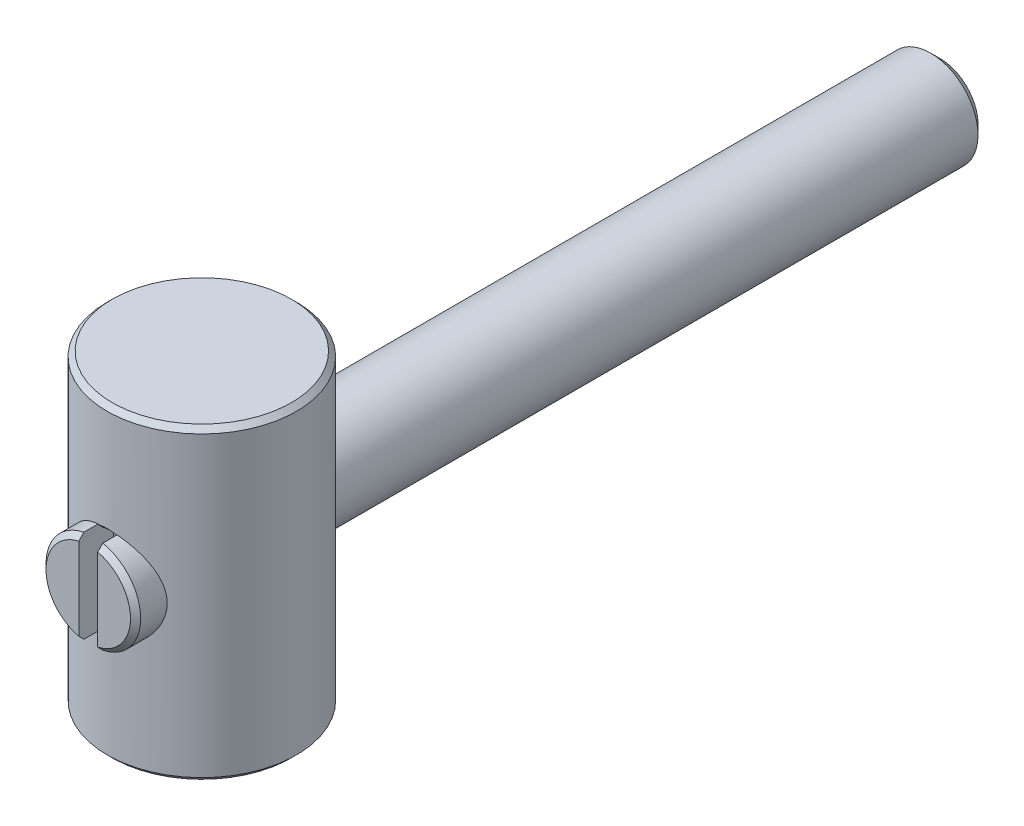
ISO-10303-21;
HEADER;
FILE_DESCRIPTION(('STEP AP214'),'2;1');
FILE_NAME('part.step','',(''),(''),'','','');
FILE_SCHEMA(('AUTOMOTIVE_DESIGN { 1 0 10303 214 1 1 1 1 }'));
ENDSEC;
DATA;
#1=APPLICATION_CONTEXT('core data for automotive mechanical design processes');
#2=APPLICATION_PROTOCOL_DEFINITION('international standard','automotive_design',2000,#1);
#3=PRODUCT_CONTEXT('',#1,'mechanical');
#4=PRODUCT('Part','Part','',(#3));
#5=PRODUCT_RELATED_PRODUCT_CATEGORY('part','',(#4));
#6=PRODUCT_DEFINITION_FORMATION('','',#4);
#7=PRODUCT_DEFINITION_CONTEXT('part definition',#1,'design');
#8=PRODUCT_DEFINITION('design','',#6,#7);
#9=PRODUCT_DEFINITION_SHAPE('','',#8);
#10=(LENGTH_UNIT() NAMED_UNIT(*) SI_UNIT(.MILLI.,.METRE.));
#11=(NAMED_UNIT(*) PLANE_ANGLE_UNIT() SI_UNIT($,.RADIAN.));
#12=(NAMED_UNIT(*) SI_UNIT($,.STERADIAN.) SOLID_ANGLE_UNIT());
#13=UNCERTAINTY_MEASURE_WITH_UNIT(LENGTH_MEASURE(1.E-05),#10,'distance_accuracy_value','');
#14=(GEOMETRIC_REPRESENTATION_CONTEXT(3) GLOBAL_UNCERTAINTY_ASSIGNED_CONTEXT((#13)) GLOBAL_UNIT_ASSIGNED_CONTEXT((#10,
#11,#12)) REPRESENTATION_CONTEXT('',''));
#15=CARTESIAN_POINT('',(0.,0.,0.));
#16=DIRECTION('',(0.,0.,1.));
#17=DIRECTION('',(1.,0.,0.));
#18=AXIS2_PLACEMENT_3D('',#15,#16,#17);
#19=CARTESIAN_POINT('',(0.,0.,4.8));
#20=DIRECTION('',(0.,0.,-1.));
#21=DIRECTION('',(-1.,0.,0.));
#22=AXIS2_PLACEMENT_3D('',#19,#20,#21);
#23=PLANE('',#22);
#24=DIRECTION('',(0.,-1.,0.));
#25=VECTOR('',#24,1.);
#26=CARTESIAN_POINT('',(-0.4,0.,4.8));
#27=LINE('',#26,#25);
#28=CARTESIAN_POINT('',(-0.4,1.74011788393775,4.8));
#29=VERTEX_POINT('',#28);
#30=CARTESIAN_POINT('',(-0.4,-1.74011788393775,4.8));
#31=VERTEX_POINT('',#30);
#32=EDGE_CURVE('E123',#29,#31,#27,.T.);
#33=ORIENTED_EDGE('',*,*,#32,.F.);
#34=CARTESIAN_POINT('',(0.,0.,4.8));
#35=DIRECTION('',(0.,0.,-1.));
#36=DIRECTION('',(-1.,0.,0.));
#37=AXIS2_PLACEMENT_3D('',#34,#35,#36);
#38=CIRCLE('',#37,1.7855);
#39=EDGE_CURVE('E122',#31,#29,#38,.T.);
#40=ORIENTED_EDGE('',*,*,#39,.F.);
#41=EDGE_LOOP('',(#33,#40));
#42=FACE_BOUND('',#41,.T.);
#43=ADVANCED_FACE('F14',(#42),#23,.F.);
#44=CARTESIAN_POINT('',(0.,0.,4.8));
#45=DIRECTION('',(0.,0.,-1.));
#46=DIRECTION('',(-1.,0.,0.));
#47=AXIS2_PLACEMENT_3D('',#44,#45,#46);
#48=CONICAL_SURFACE('',#47,1.7855,0.785398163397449);
#49=CARTESIAN_POINT('',(-0.4,4.38544390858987,2.18185170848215));
#50=CARTESIAN_POINT('',(-0.4,4.22814452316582,2.33849490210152));
#51=CARTESIAN_POINT('',(-0.4,4.07081593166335,2.49510881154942));
#52=CARTESIAN_POINT('',(-0.4,3.75604765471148,2.80824900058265));
#53=CARTESIAN_POINT('',(-0.4,3.59860796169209,2.96477527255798));
#54=CARTESIAN_POINT('',(-0.4,3.28330186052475,3.27797222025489));
#55=CARTESIAN_POINT('',(-0.4,3.12543519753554,3.43464263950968));
#56=CARTESIAN_POINT('',(-0.4,2.80949525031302,3.74775156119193));
#57=CARTESIAN_POINT('',(-0.4,2.65142198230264,3.90419007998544));
#58=CARTESIAN_POINT('',(-0.4,2.34523716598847,4.20651333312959));
#59=CARTESIAN_POINT('',(-0.4,2.19714827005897,4.35242098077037));
#60=CARTESIAN_POINT('',(-0.4,1.9745743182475,4.57086698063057));
#61=CARTESIAN_POINT('',(-0.4,1.90030121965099,4.64362119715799));
#62=CARTESIAN_POINT('',(-0.4,1.75155548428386,4.78892225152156));
#63=CARTESIAN_POINT('',(-0.4,1.67708285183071,4.86146909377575));
#64=CARTESIAN_POINT('',(-0.4,1.52792681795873,5.0061860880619));
#65=CARTESIAN_POINT('',(-0.4,1.45324372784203,5.07835656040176));
#66=CARTESIAN_POINT('',(-0.4,1.303425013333,5.22223884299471));
#67=CARTESIAN_POINT('',(-0.4,1.22828935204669,5.29395061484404));
#68=CARTESIAN_POINT('',(-0.4,1.07732483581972,5.436586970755));
#69=CARTESIAN_POINT('',(-0.4,1.00149626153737,5.50751184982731));
#70=CARTESIAN_POINT('',(-0.4,0.886762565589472,5.61281093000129));
#71=CARTESIAN_POINT('',(-0.4,0.848355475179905,5.64772694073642));
#72=CARTESIAN_POINT('',(-0.4,0.771065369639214,5.71702726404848));
#73=CARTESIAN_POINT('',(-0.4,0.732182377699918,5.75141160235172));
#74=CARTESIAN_POINT('',(-0.4,0.670990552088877,5.80440505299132));
#75=CARTESIAN_POINT('',(-0.4,0.648923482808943,5.82329300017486));
#76=CARTESIAN_POINT('',(-0.4,0.604504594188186,5.86073627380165));
#77=CARTESIAN_POINT('',(-0.4,0.582152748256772,5.87929156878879));
#78=CARTESIAN_POINT('',(-0.4,0.536811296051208,5.91617925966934));
#79=CARTESIAN_POINT('',(-0.4,0.513817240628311,5.9345062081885));
#80=CARTESIAN_POINT('',(-0.4,0.467342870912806,5.97052571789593));
#81=CARTESIAN_POINT('',(-0.4,0.443862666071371,5.98821841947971));
#82=CARTESIAN_POINT('',(-0.4,0.395899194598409,6.02295404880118));
#83=CARTESIAN_POINT('',(-0.4,0.371406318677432,6.0399838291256));
#84=CARTESIAN_POINT('',(-0.4,0.321466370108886,6.07268136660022));
#85=CARTESIAN_POINT('',(-0.4,0.296018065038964,6.08834727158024));
#86=CARTESIAN_POINT('',(-0.4,0.244218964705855,6.11732584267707));
#87=CARTESIAN_POINT('',(-0.4,0.217884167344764,6.13066640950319));
#88=CARTESIAN_POINT('',(-0.4,0.1637878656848,6.15395132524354));
#89=CARTESIAN_POINT('',(-0.4,0.136031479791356,6.16390699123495));
#90=CARTESIAN_POINT('',(-0.4,0.0811637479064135,6.17813666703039));
#91=CARTESIAN_POINT('',(-0.4,0.0541522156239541,6.18277112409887));
#92=CARTESIAN_POINT('',(-0.4,-0.000201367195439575,6.18641177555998));
#93=CARTESIAN_POINT('',(-0.4,-0.0275422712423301,6.18543380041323));
#94=CARTESIAN_POINT('',(-0.4,-0.08124913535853,6.17820280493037));
#95=CARTESIAN_POINT('',(-0.4,-0.107621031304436,6.17199093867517));
#96=CARTESIAN_POINT('',(-0.4,-0.146271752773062,6.15977299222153));
#97=CARTESIAN_POINT('',(-0.4,-0.159041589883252,6.1551986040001));
#98=CARTESIAN_POINT('',(-0.4,-0.184264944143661,6.14525020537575));
#99=CARTESIAN_POINT('',(-0.4,-0.196718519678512,6.13987634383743));
#100=CARTESIAN_POINT('',(-0.4,-0.23353200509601,6.12283069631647));
#101=CARTESIAN_POINT('',(-0.4,-0.257445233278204,6.1102004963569));
#102=CARTESIAN_POINT('',(-0.4,-0.304317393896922,6.08326318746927));
#103=CARTESIAN_POINT('',(-0.4,-0.327275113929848,6.06895403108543));
#104=CARTESIAN_POINT('',(-0.4,-0.37252645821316,6.03916204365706));
#105=CARTESIAN_POINT('',(-0.4,-0.39481743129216,6.0236752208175));
#106=CARTESIAN_POINT('',(-0.4,-0.438833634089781,5.99191398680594));
#107=CARTESIAN_POINT('',(-0.4,-0.460558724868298,5.97563938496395));
#108=CARTESIAN_POINT('',(-0.4,-0.525520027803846,5.92565754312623));
#109=CARTESIAN_POINT('',(-0.4,-0.568098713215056,5.89109840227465));
#110=CARTESIAN_POINT('',(-0.4,-0.631123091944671,5.83837882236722));
#111=CARTESIAN_POINT('',(-0.4,-0.651965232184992,5.82068135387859));
#112=CARTESIAN_POINT('',(-0.4,-0.693435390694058,5.7850382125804));
#113=CARTESIAN_POINT('',(-0.4,-0.714063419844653,5.76709255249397));
#114=CARTESIAN_POINT('',(-0.4,-0.774606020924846,5.71392260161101));
#115=CARTESIAN_POINT('',(-0.4,-0.814284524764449,5.67843014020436));
#116=CARTESIAN_POINT('',(-0.4,-0.893204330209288,5.60696168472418));
#117=CARTESIAN_POINT('',(-0.4,-0.932445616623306,5.57098567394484));
#118=CARTESIAN_POINT('',(-0.4,-1.04971807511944,5.46255349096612));
#119=CARTESIAN_POINT('',(-0.4,-1.12728939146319,5.38960072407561));
#120=CARTESIAN_POINT('',(-0.4,-1.28178514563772,5.24296666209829));
#121=CARTESIAN_POINT('',(-0.4,-1.35870936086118,5.16928513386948));
#122=CARTESIAN_POINT('',(-0.4,-1.51213277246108,5.0214909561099));
#123=CARTESIAN_POINT('',(-0.4,-1.58863199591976,4.94737833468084));
#124=CARTESIAN_POINT('',(-0.4,-1.81796193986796,4.72440140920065));
#125=CARTESIAN_POINT('',(-0.4,-1.97038982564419,4.57512336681));
#126=CARTESIAN_POINT('',(-0.4,-2.27470082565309,4.27606244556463));
#127=CARTESIAN_POINT('',(-0.4,-2.4265840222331,4.12627965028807));
#128=CARTESIAN_POINT('',(-0.4,-2.65349094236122,3.90205377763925));
#129=CARTESIAN_POINT('',(-0.4,-2.72863003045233,3.82772743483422));
#130=CARTESIAN_POINT('',(-0.4,-2.87885103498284,3.67901233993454));
#131=CARTESIAN_POINT('',(-0.4,-2.95393294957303,3.60462358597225));
#132=CARTESIAN_POINT('',(-0.4,-3.17903278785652,3.3814616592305));
#133=CARTESIAN_POINT('',(-0.4,-3.32898065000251,3.23261781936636));
#134=CARTESIAN_POINT('',(-0.4,-3.63002720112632,2.93354169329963));
#135=CARTESIAN_POINT('',(-0.4,-3.78112484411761,2.78330835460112));
#136=CARTESIAN_POINT('',(-0.4,-4.0833055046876,2.48267648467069));
#137=CARTESIAN_POINT('',(-0.4,-4.2343884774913,2.3322779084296));
#138=CARTESIAN_POINT('',(-0.4,-4.38544390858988,2.18185170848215));
#139=B_SPLINE_CURVE_WITH_KNOTS('',3,(#49,#50,#51,#52,#53,#54,#55,#56,#57,#58,#59,#60,#61,#62,
#63,#64,#65,#66,#67,#68,#69,#70,#71,#72,#73,#74,#75,#76,#77,#78,#79,#80,#81,#82,#83,#84,#85,#86,
#87,#88,#89,#90,#91,#92,#93,#94,#95,#96,#97,#98,#99,#100,#101,#102,#103,#104,#105,#106,#107,
#108,#109,#110,#111,#112,#113,#114,#115,#116,#117,#118,#119,#120,#121,#122,#123,#124,#125,#126,
#127,#128,#129,#130,#131,#132,#133,#134,#135,#136,#137,#138),.UNSPECIFIED.,.F.,.F.,(4,2,2,2,2,2,
2,2,2,2,2,2,2,2,2,2,2,2,2,2,2,2,2,2,2,2,2,2,2,2,2,2,2,2,2,2,2,2,2,2,2,2,2,2,4),(0.,
0.665974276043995,1.33199943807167,1.99923802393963,2.6664270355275,3.29010400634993,
3.60201239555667,3.91391408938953,4.22548161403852,4.53707489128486,4.84854710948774,
5.00426229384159,5.15996991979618,5.24710757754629,5.33425343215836,5.42245810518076,
5.51064313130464,5.60010728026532,5.68969108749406,5.77811232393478,5.86623495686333,
5.9479508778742,6.0294364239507,6.1102871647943,6.15096076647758,6.19162680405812,
6.27264196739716,6.35375697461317,6.43516036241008,6.5165835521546,6.68104442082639,
6.76307124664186,6.84509388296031,7.00479619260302,7.16450403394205,7.48395372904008,
7.80350915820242,8.12304398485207,8.76309054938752,9.40303588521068,9.72010458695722,
10.037183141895,10.6710202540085,11.3102423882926,11.9497829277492),.UNSPECIFIED.);
#140=CARTESIAN_POINT('',(-0.4,1.95959179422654,4.5855));
#141=VERTEX_POINT('',#140);
#142=EDGE_CURVE('E104',#141,#29,#139,.T.);
#143=ORIENTED_EDGE('',*,*,#142,.F.);
#144=CARTESIAN_POINT('',(0.,0.,4.5855));
#145=DIRECTION('',(0.,0.,-1.));
#146=DIRECTION('',(-1.,0.,0.));
#147=AXIS2_PLACEMENT_3D('',#144,#145,#146);
#148=CIRCLE('',#147,2.);
#149=CARTESIAN_POINT('',(-0.4,-1.95959179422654,4.5855));
#150=VERTEX_POINT('',#149);
#151=EDGE_CURVE('E120',#150,#141,#148,.T.);
#152=ORIENTED_EDGE('',*,*,#151,.F.);
#153=EDGE_CURVE('E126',#31,#150,#139,.T.);
#154=ORIENTED_EDGE('',*,*,#153,.F.);
#155=ORIENTED_EDGE('',*,*,#39,.T.);
#156=EDGE_LOOP('',(#143,#152,#154,#155));
#157=FACE_BOUND('',#156,.T.);
#158=ADVANCED_FACE('F118',(#157),#48,.T.);
#159=CARTESIAN_POINT('',(0.4,0.,34.8));
#160=DIRECTION('',(-1.,0.,0.));
#161=DIRECTION('',(0.,-1.,0.));
#162=AXIS2_PLACEMENT_3D('',#159,#160,#161);
#163=CYLINDRICAL_SURFACE('',#162,31.5);
#164=CARTESIAN_POINT('',(0.4,-1.76576053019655,3.34952957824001));
#165=CARTESIAN_POINT('',(0.349977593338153,-1.77709824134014,3.35016706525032));
#166=CARTESIAN_POINT('',(0.299469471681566,-1.78629930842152,3.35068890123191));
#167=CARTESIAN_POINT('',(0.197847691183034,-1.80038671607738,3.35149171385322));
#168=CARTESIAN_POINT('',(0.146733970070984,-1.8052726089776,3.35177266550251));
#169=CARTESIAN_POINT('',(0.0452193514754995,-1.81063609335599,3.35208115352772));
#170=CARTESIAN_POINT('',(-0.00517737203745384,-1.81119308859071,3.35211325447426));
#171=CARTESIAN_POINT('',(-0.105833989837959,-1.80810483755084,3.3519355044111));
#172=CARTESIAN_POINT('',(-0.156093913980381,-1.8044605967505,3.35172571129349));
#173=CARTESIAN_POINT('',(-0.238696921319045,-1.79499603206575,3.3511843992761));
#174=CARTESIAN_POINT('',(-0.271182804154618,-1.7903758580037,3.35092073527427));
#175=CARTESIAN_POINT('',(-0.335843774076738,-1.77938039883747,3.35029676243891));
#176=CARTESIAN_POINT('',(-0.368018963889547,-1.77300571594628,3.34993648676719));
#177=CARTESIAN_POINT('',(-0.4,-1.76576053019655,3.34952957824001));
#178=B_SPLINE_CURVE_WITH_KNOTS('',3,(#164,#165,#166,#167,#168,#169,#170,#171,#172,#173,#174,
#175,#176,#177),.UNSPECIFIED.,.F.,.F.,(4,2,2,2,2,2,4),(0.,0.153839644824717,0.307695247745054,
0.458721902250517,0.609712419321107,0.708108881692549,0.806471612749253),.UNSPECIFIED.);
#179=CARTESIAN_POINT('',(0.4,-1.76576053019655,3.34952957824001));
#180=VERTEX_POINT('',#179);
#181=CARTESIAN_POINT('',(-0.4,-1.76576053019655,3.34952957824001));
#182=VERTEX_POINT('',#181);
#183=EDGE_CURVE('E250',#180,#182,#178,.T.);
#184=ORIENTED_EDGE('',*,*,#183,.F.);
#185=CARTESIAN_POINT('',(0.4,0.,34.8));
#186=DIRECTION('',(1.,0.,0.));
#187=DIRECTION('',(0.,1.,0.));
#188=AXIS2_PLACEMENT_3D('',#185,#186,#187);
#189=CIRCLE('',#188,31.5);
#190=CARTESIAN_POINT('',(0.4,1.76576053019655,3.34952957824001));
#191=VERTEX_POINT('',#190);
#192=EDGE_CURVE('E124',#180,#191,#189,.T.);
#193=ORIENTED_EDGE('',*,*,#192,.T.);
#194=CARTESIAN_POINT('',(-0.4,1.76576053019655,3.34952957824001));
#195=CARTESIAN_POINT('',(-0.349977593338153,1.77709824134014,3.35016706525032));
#196=CARTESIAN_POINT('',(-0.299469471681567,1.78629930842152,3.35068890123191));
#197=CARTESIAN_POINT('',(-0.197847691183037,1.80038671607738,3.35149171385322));
#198=CARTESIAN_POINT('',(-0.146733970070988,1.8052726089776,3.35177266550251));
#199=CARTESIAN_POINT('',(-0.0452193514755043,1.81063609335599,3.35208115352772));
#200=CARTESIAN_POINT('',(0.00517737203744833,1.81119308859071,3.35211325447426));
#201=CARTESIAN_POINT('',(0.105833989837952,1.80810483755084,3.3519355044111));
#202=CARTESIAN_POINT('',(0.156093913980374,1.8044605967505,3.35172571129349));
#203=CARTESIAN_POINT('',(0.238696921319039,1.79499603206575,3.3511843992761));
#204=CARTESIAN_POINT('',(0.271182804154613,1.7903758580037,3.35092073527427));
#205=CARTESIAN_POINT('',(0.335843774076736,1.77938039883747,3.35029676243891));
#206=CARTESIAN_POINT('',(0.368018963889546,1.77300571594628,3.34993648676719));
#207=CARTESIAN_POINT('',(0.4,1.76576053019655,3.34952957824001));
#208=B_SPLINE_CURVE_WITH_KNOTS('',3,(#194,#195,#196,#197,#198,#199,#200,#201,#202,#203,#204,
#205,#206,#207),.UNSPECIFIED.,.F.,.F.,(4,2,2,2,2,2,4),(0.,0.153839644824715,0.307695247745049,
0.45872190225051,0.609712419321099,0.708108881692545,0.806471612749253),.UNSPECIFIED.);
#209=CARTESIAN_POINT('',(-0.4,1.76576053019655,3.34952957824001));
#210=VERTEX_POINT('',#209);
#211=EDGE_CURVE('E248',#210,#191,#208,.T.);
#212=ORIENTED_EDGE('',*,*,#211,.F.);
#213=CARTESIAN_POINT('',(-0.4,0.,34.8));
#214=DIRECTION('',(1.,0.,0.));
#215=DIRECTION('',(0.,1.,0.));
#216=AXIS2_PLACEMENT_3D('',#213,#214,#215);
#217=CIRCLE('',#216,31.5);
#218=EDGE_CURVE('E238',#182,#210,#217,.T.);
#219=ORIENTED_EDGE('',*,*,#218,.F.);
#220=EDGE_LOOP('',(#184,#193,#212,#219));
#221=FACE_BOUND('',#220,.T.);
#222=ADVANCED_FACE('F245',(#221),#163,.F.);
#223=CARTESIAN_POINT('',(0.,0.,-4.7));
#224=DIRECTION('',(0.,0.,-1.));
#225=DIRECTION('',(-1.,0.,0.));
#226=AXIS2_PLACEMENT_3D('',#223,#224,#225);
#227=CYLINDRICAL_SURFACE('',#226,2.);
#228=CARTESIAN_POINT('',(-2.,0.,3.46410161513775));
#229=CARTESIAN_POINT('',(-1.99999158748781,0.104213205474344,3.46411185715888));
#230=CARTESIAN_POINT('',(-1.99179963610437,0.208562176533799,3.46887633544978));
#231=CARTESIAN_POINT('',(-1.95944672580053,0.4140551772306,3.48724701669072));
#232=CARTESIAN_POINT('',(-1.93525221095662,0.51519200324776,3.50087179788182));
#233=CARTESIAN_POINT('',(-1.8721998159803,0.710903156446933,3.53498701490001));
#234=CARTESIAN_POINT('',(-1.83341988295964,0.805509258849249,3.55544089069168));
#235=CARTESIAN_POINT('',(-1.74253507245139,0.986848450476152,3.60085327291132));
#236=CARTESIAN_POINT('',(-1.69042947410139,1.07358111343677,3.62581202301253));
#237=CARTESIAN_POINT('',(-1.56933307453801,1.24461144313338,3.67993738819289));
#238=CARTESIAN_POINT('',(-1.49930407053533,1.32811826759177,3.70928127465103));
#239=CARTESIAN_POINT('',(-1.34650761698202,1.4828167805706,3.76743965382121));
#240=CARTESIAN_POINT('',(-1.26373385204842,1.55400232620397,3.79625387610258));
#241=CARTESIAN_POINT('',(-1.08097912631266,1.6867343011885,3.85242953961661));
#242=CARTESIAN_POINT('',(-0.980214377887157,1.74730753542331,3.87956212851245));
#243=CARTESIAN_POINT('',(-0.768314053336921,1.85028170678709,3.92701512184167));
#244=CARTESIAN_POINT('',(-0.65718507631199,1.8926941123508,3.94733982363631));
#245=CARTESIAN_POINT('',(-0.436089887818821,1.95500932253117,3.97760922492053));
#246=CARTESIAN_POINT('',(-0.326603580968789,1.9762990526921,3.9881896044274));
#247=CARTESIAN_POINT('',(-0.105141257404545,2.00033223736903,4.00015167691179));
#248=CARTESIAN_POINT('',(0.00683321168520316,2.00308691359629,4.00153893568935));
#249=CARTESIAN_POINT('',(0.219665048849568,1.99050665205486,3.99525963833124));
#250=CARTESIAN_POINT('',(0.320642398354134,1.97672396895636,3.98836991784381));
#251=CARTESIAN_POINT('',(0.518627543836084,1.93423831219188,3.96748490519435));
#252=CARTESIAN_POINT('',(0.615635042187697,1.90553422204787,3.95348908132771));
#253=CARTESIAN_POINT('',(0.804618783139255,1.83383486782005,3.91943166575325));
#254=CARTESIAN_POINT('',(0.896506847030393,1.79064737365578,3.89928883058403));
#255=CARTESIAN_POINT('',(1.07195360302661,1.6914731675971,3.8547529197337));
#256=CARTESIAN_POINT('',(1.15550929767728,1.63548187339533,3.83035832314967));
#257=CARTESIAN_POINT('',(1.3203473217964,1.50620929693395,3.7768878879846));
#258=CARTESIAN_POINT('',(1.40066815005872,1.43179394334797,3.74758751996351));
#259=CARTESIAN_POINT('',(1.54820874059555,1.27082055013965,3.68908681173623));
#260=CARTESIAN_POINT('',(1.61541842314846,1.18425325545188,3.65988656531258));
#261=CARTESIAN_POINT('',(1.73901066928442,0.994703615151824,3.60288312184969));
#262=CARTESIAN_POINT('',(1.7944346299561,0.891027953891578,3.57528639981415));
#263=CARTESIAN_POINT('',(1.88663822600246,0.674124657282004,3.52750900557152));
#264=CARTESIAN_POINT('',(1.92343731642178,0.560907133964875,3.50732060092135));
#265=CARTESIAN_POINT('',(1.97436042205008,0.337570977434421,3.47889271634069));
#266=CARTESIAN_POINT('',(1.99005024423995,0.227917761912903,3.46983311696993));
#267=CARTESIAN_POINT('',(2.00303389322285,0.00719731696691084,3.46235838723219));
#268=CARTESIAN_POINT('',(2.00034071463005,-0.103868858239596,3.46393573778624));
#269=CARTESIAN_POINT('',(1.97807208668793,-0.311307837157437,3.4766867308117));
#270=CARTESIAN_POINT('',(1.96037563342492,-0.407958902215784,3.48679175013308));
#271=CARTESIAN_POINT('',(1.91139256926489,-0.596735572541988,3.51388043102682));
#272=CARTESIAN_POINT('',(1.88010155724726,-0.688859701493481,3.53086632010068));
#273=CARTESIAN_POINT('',(1.80329517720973,-0.870822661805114,3.57072444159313));
#274=CARTESIAN_POINT('',(1.75718812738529,-0.96035803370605,3.59383286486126));
#275=CARTESIAN_POINT('',(1.65257412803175,-1.13093854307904,3.643122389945));
#276=CARTESIAN_POINT('',(1.59406080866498,-1.21197928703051,3.66930506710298));
#277=CARTESIAN_POINT('',(1.45767433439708,-1.37395753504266,3.72575996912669));
#278=CARTESIAN_POINT('',(1.37829054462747,-1.45359430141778,3.75613166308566));
#279=CARTESIAN_POINT('',(1.20680899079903,-1.59882447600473,3.81468469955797));
#280=CARTESIAN_POINT('',(1.1147069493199,-1.66441314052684,3.84286530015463));
#281=CARTESIAN_POINT('',(0.917070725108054,-1.78114745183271,3.89482723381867));
#282=CARTESIAN_POINT('',(0.81124619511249,-1.83186623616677,3.91847283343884));
#283=CARTESIAN_POINT('',(0.591044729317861,-1.91427580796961,3.95766709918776));
#284=CARTESIAN_POINT('',(0.476675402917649,-1.9459833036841,3.97322287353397));
#285=CARTESIAN_POINT('',(0.25395936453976,-1.98673712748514,3.99335016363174));
#286=CARTESIAN_POINT('',(0.146022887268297,-1.99759574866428,3.9987985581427));
#287=CARTESIAN_POINT('',(-0.0702519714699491,-2.00168653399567,4.00084260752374));
#288=CARTESIAN_POINT('',(-0.178590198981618,-1.99492486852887,3.99744136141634));
#289=CARTESIAN_POINT('',(-0.385075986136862,-1.96516717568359,3.98267937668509));
#290=CARTESIAN_POINT('',(-0.483424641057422,-1.94327026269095,3.97185789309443));
#291=CARTESIAN_POINT('',(-0.674891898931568,-1.88534604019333,3.94384187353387));
#292=CARTESIAN_POINT('',(-0.768009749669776,-1.84931670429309,3.92664642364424));
#293=CARTESIAN_POINT('',(-0.950846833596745,-1.7625457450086,3.8865186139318));
#294=CARTESIAN_POINT('',(-1.0402503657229,-1.71124078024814,3.86337234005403));
#295=CARTESIAN_POINT('',(-1.20954920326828,-1.59608471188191,3.81376266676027));
#296=CARTESIAN_POINT('',(-1.28944011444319,-1.53222784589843,3.78729774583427));
#297=CARTESIAN_POINT('',(-1.44582833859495,-1.38640336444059,3.73057218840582));
#298=CARTESIAN_POINT('',(-1.52119665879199,-1.30326581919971,3.70019591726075));
#299=CARTESIAN_POINT('',(-1.65732528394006,-1.12510777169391,3.64126158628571));
#300=CARTESIAN_POINT('',(-1.71807266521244,-1.03007686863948,3.61270515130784));
#301=CARTESIAN_POINT('',(-1.82486714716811,-0.826691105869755,3.55999186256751));
#302=CARTESIAN_POINT('',(-1.87038902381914,-0.718010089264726,3.53600256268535));
#303=CARTESIAN_POINT('',(-1.92395929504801,-0.549421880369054,3.5069621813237));
#304=CARTESIAN_POINT('',(-1.93935666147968,-0.492352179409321,3.49844389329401));
#305=CARTESIAN_POINT('',(-1.96508069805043,-0.376767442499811,3.48406059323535));
#306=CARTESIAN_POINT('',(-1.97541091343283,-0.318253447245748,3.4781937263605));
#307=CARTESIAN_POINT('',(-1.98872932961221,-0.21639921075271,3.47059023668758));
#308=CARTESIAN_POINT('',(-1.99295091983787,-0.173266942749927,3.46816389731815));
#309=CARTESIAN_POINT('',(-1.99858810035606,-0.0867643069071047,3.46491740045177));
#310=CARTESIAN_POINT('',(-2.00000350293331,-0.0433939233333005,3.46409735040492));
#311=CARTESIAN_POINT('',(-2.,0.,3.46410161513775));
#312=B_SPLINE_CURVE_WITH_KNOTS('',3,(#228,#229,#230,#231,#232,#233,#234,#235,#236,#237,#238,
#239,#240,#241,#242,#243,#244,#245,#246,#247,#248,#249,#250,#251,#252,#253,#254,#255,#256,#257,
#258,#259,#260,#261,#262,#263,#264,#265,#266,#267,#268,#269,#270,#271,#272,#273,#274,#275,#276,
#277,#278,#279,#280,#281,#282,#283,#284,#285,#286,#287,#288,#289,#290,#291,#292,#293,#294,#295,
#296,#297,#298,#299,#300,#301,#302,#303,#304,#305,#306,#307,#308,#309,#310,#311),.UNSPECIFIED.,
.T.,.F.,(4,2,2,2,2,2,2,2,2,2,2,2,2,2,2,2,2,2,2,2,2,2,2,2,2,2,2,2,2,2,2,2,2,2,2,2,2,2,2,2,2,4),
(0.,0.312464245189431,0.625585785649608,0.937057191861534,1.24854545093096,1.58572462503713,
1.92307142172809,2.28315784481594,2.64301653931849,2.97726969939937,3.31132047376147,
3.61632194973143,3.92134625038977,4.2305906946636,4.5399459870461,4.87854382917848,
5.21740096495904,5.57777683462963,5.93777548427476,6.2692458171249,6.60048186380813,
6.89548366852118,7.19058104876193,7.49934592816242,7.80826972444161,8.15613487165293,
8.50411729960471,8.86128362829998,9.2181355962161,9.5422454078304,9.8662417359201,
10.1688884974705,10.4715786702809,10.7872150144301,11.102996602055,11.450204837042,
11.7977188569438,12.1562149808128,12.3351395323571,12.5139387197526,12.6440387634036,
12.7741475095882),.UNSPECIFIED.);
#313=CARTESIAN_POINT('',(-0.4,-1.95959179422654,3.97994974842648));
#314=VERTEX_POINT('',#313);
#315=CARTESIAN_POINT('',(-0.4,1.95959179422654,3.97994974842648));
#316=VERTEX_POINT('',#315);
#317=EDGE_CURVE('E319',#314,#316,#312,.T.);
#318=ORIENTED_EDGE('',*,*,#317,.F.);
#319=DIRECTION('',(0.,0.,-1.));
#320=VECTOR('',#319,1.);
#321=CARTESIAN_POINT('',(-0.4,-1.95959179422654,-4.7));
#322=LINE('',#321,#320);
#323=EDGE_CURVE('E129',#150,#314,#322,.T.);
#324=ORIENTED_EDGE('',*,*,#323,.F.);
#325=ORIENTED_EDGE('',*,*,#151,.T.);
#326=DIRECTION('',(0.,0.,-1.));
#327=VECTOR('',#326,1.);
#328=CARTESIAN_POINT('',(-0.4,1.95959179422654,-4.7));
#329=LINE('',#328,#327);
#330=EDGE_CURVE('E100',#316,#141,#329,.F.);
#331=ORIENTED_EDGE('',*,*,#330,.F.);
#332=EDGE_LOOP('',(#318,#324,#325,#331));
#333=FACE_BOUND('',#332,.T.);
#334=ADVANCED_FACE('F128',(#333),#227,.T.);
#335=CARTESIAN_POINT('',(-0.4,0.,34.8));
#336=DIRECTION('',(1.,0.,0.));
#337=DIRECTION('',(0.,1.,0.));
#338=AXIS2_PLACEMENT_3D('',#335,#336,#337);
#339=PLANE('',#338);
#340=ORIENTED_EDGE('',*,*,#323,.T.);
#341=DIRECTION('',(0.,1.,0.));
#342=VECTOR('',#341,1.);
#343=CARTESIAN_POINT('',(-0.4,6.5,3.97994974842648));
#344=LINE('',#343,#342);
#345=CARTESIAN_POINT('',(-0.4,-1.93912377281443,3.97994974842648));
#346=VERTEX_POINT('',#345);
#347=EDGE_CURVE('E257',#314,#346,#344,.T.);
#348=ORIENTED_EDGE('',*,*,#347,.T.);
#349=CARTESIAN_POINT('',(-0.4,-0.624920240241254,2.74197392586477));
#350=CARTESIAN_POINT('',(-0.4,-0.652653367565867,2.76534479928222));
#351=CARTESIAN_POINT('',(-0.4,-0.680175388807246,2.7889624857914));
#352=CARTESIAN_POINT('',(-0.4,-0.734883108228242,2.83658066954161));
#353=CARTESIAN_POINT('',(-0.4,-0.762068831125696,2.86058113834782));
#354=CARTESIAN_POINT('',(-0.4,-0.843247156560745,2.93298747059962));
#355=CARTESIAN_POINT('',(-0.4,-0.896870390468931,2.98180637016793));
#356=CARTESIAN_POINT('',(-0.4,-1.00349672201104,3.0800847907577));
#357=CARTESIAN_POINT('',(-0.4,-1.05649998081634,3.12954413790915));
#358=CARTESIAN_POINT('',(-0.4,-1.16210748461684,3.22889159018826));
#359=CARTESIAN_POINT('',(-0.4,-1.21471171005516,3.2787797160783));
#360=CARTESIAN_POINT('',(-0.4,-1.34837868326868,3.40624444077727));
#361=CARTESIAN_POINT('',(-0.4,-1.42924950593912,3.48402202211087));
#362=CARTESIAN_POINT('',(-0.4,-1.59060014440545,3.63999652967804));
#363=CARTESIAN_POINT('',(-0.4,-1.67107992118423,3.71819349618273));
#364=CARTESIAN_POINT('',(-0.4,-1.84349823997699,3.88628324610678));
#365=CARTESIAN_POINT('',(-0.4,-1.93539571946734,3.97621812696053));
#366=CARTESIAN_POINT('',(-0.4,-2.11896570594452,4.15631699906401));
#367=CARTESIAN_POINT('',(-0.4,-2.21063821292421,4.24648099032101));
#368=CARTESIAN_POINT('',(-0.4,-2.39380444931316,4.42694304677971));
#369=CARTESIAN_POINT('',(-0.4,-2.48529821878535,4.51724107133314));
#370=CARTESIAN_POINT('',(-0.4,-2.66817104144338,4.69795263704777));
#371=CARTESIAN_POINT('',(-0.4,-2.75955009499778,4.78836617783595));
#372=CARTESIAN_POINT('',(-0.4,-2.85089224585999,4.87881687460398));
#373=B_SPLINE_CURVE_WITH_KNOTS('',3,(#349,#350,#351,#352,#353,#354,#355,#356,#357,#358,#359,
#360,#361,#362,#363,#364,#365,#366,#367,#368,#369,#370,#371,#372),.UNSPECIFIED.,.F.,.F.,(4,2,2,
2,2,2,2,2,2,2,2,4),(0.,0.108797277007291,0.217586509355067,0.435127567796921,0.65261075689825,
0.870104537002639,1.20670989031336,1.54334816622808,1.92909464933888,2.31484114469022,
2.70048799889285,3.08613361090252),.UNSPECIFIED.);
#374=CARTESIAN_POINT('',(-0.4,-1.76576053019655,3.8105));
#375=VERTEX_POINT('',#374);
#376=EDGE_CURVE('E189',#375,#346,#373,.T.);
#377=ORIENTED_EDGE('',*,*,#376,.F.);
#378=DIRECTION('',(0.,0.,-1.));
#379=VECTOR('',#378,1.);
#380=CARTESIAN_POINT('',(-0.4,-1.76576053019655,-4.));
#381=LINE('',#380,#379);
#382=EDGE_CURVE('E320',#182,#375,#381,.F.);
#383=ORIENTED_EDGE('',*,*,#382,.F.);
#384=ORIENTED_EDGE('',*,*,#218,.T.);
#385=DIRECTION('',(0.,0.,-1.));
#386=VECTOR('',#385,1.);
#387=CARTESIAN_POINT('',(-0.4,1.76576053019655,-4.));
#388=LINE('',#387,#386);
#389=CARTESIAN_POINT('',(-0.4,1.76576053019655,3.8105));
#390=VERTEX_POINT('',#389);
#391=EDGE_CURVE('E146',#390,#210,#388,.T.);
#392=ORIENTED_EDGE('',*,*,#391,.F.);
#393=CARTESIAN_POINT('',(-0.4,2.91587738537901,4.94318550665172));
#394=CARTESIAN_POINT('',(-0.4,2.82350327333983,4.85167351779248));
#395=CARTESIAN_POINT('',(-0.4,2.73109369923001,4.76019722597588));
#396=CARTESIAN_POINT('',(-0.4,2.54616753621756,4.57735709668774));
#397=CARTESIAN_POINT('',(-0.4,2.45365094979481,4.48599325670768));
#398=CARTESIAN_POINT('',(-0.4,2.26848279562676,4.30342707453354));
#399=CARTESIAN_POINT('',(-0.4,2.17583124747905,4.21222471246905));
#400=CARTESIAN_POINT('',(-0.4,1.99031330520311,4.03003417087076));
#401=CARTESIAN_POINT('',(-0.4,1.897446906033,3.93904599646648));
#402=CARTESIAN_POINT('',(-0.4,1.71137075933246,3.75737997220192));
#403=CARTESIAN_POINT('',(-0.4,1.61816094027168,3.66670219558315));
#404=CARTESIAN_POINT('',(-0.4,1.43123102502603,3.48588267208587));
#405=CARTESIAN_POINT('',(-0.4,1.33751095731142,3.39574089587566));
#406=CARTESIAN_POINT('',(-0.4,1.19622398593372,3.26124884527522));
#407=CARTESIAN_POINT('',(-0.4,1.14900519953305,3.2165333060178));
#408=CARTESIAN_POINT('',(-0.4,1.05423847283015,3.12745532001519));
#409=CARTESIAN_POINT('',(-0.4,1.00669054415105,3.08309286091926));
#410=CARTESIAN_POINT('',(-0.4,0.911107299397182,2.99487455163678));
#411=CARTESIAN_POINT('',(-0.4,0.863071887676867,2.95101880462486));
#412=CARTESIAN_POINT('',(-0.4,0.790465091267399,2.8858452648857));
#413=CARTESIAN_POINT('',(-0.4,0.766169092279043,2.86422117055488));
#414=CARTESIAN_POINT('',(-0.4,0.717337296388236,2.82124351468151));
#415=CARTESIAN_POINT('',(-0.4,0.69280148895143,2.79988996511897));
#416=CARTESIAN_POINT('',(-0.4,0.668118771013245,2.77870578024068));
#417=B_SPLINE_CURVE_WITH_KNOTS('',3,(#393,#394,#395,#396,#397,#398,#399,#400,#401,#402,#403,
#404,#405,#406,#407,#408,#409,#410,#411,#412,#413,#414,#415,#416),.UNSPECIFIED.,.F.,.F.,(4,2,2,
2,2,2,2,2,2,2,2,4),(0.,0.390085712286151,0.780162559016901,1.17018750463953,1.56022169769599,
1.95034232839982,2.34044141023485,2.53553457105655,2.73062087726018,2.92574622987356,
3.02332045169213,3.12089897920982),.UNSPECIFIED.);
#418=CARTESIAN_POINT('',(-0.4,1.93912377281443,3.97994974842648));
#419=VERTEX_POINT('',#418);
#420=EDGE_CURVE('E148',#419,#390,#417,.T.);
#421=ORIENTED_EDGE('',*,*,#420,.F.);
#422=EDGE_CURVE('E107',#419,#316,#344,.T.);
#423=ORIENTED_EDGE('',*,*,#422,.T.);
#424=ORIENTED_EDGE('',*,*,#330,.T.);
#425=ORIENTED_EDGE('',*,*,#142,.T.);
#426=ORIENTED_EDGE('',*,*,#32,.T.);
#427=ORIENTED_EDGE('',*,*,#153,.T.);
#428=EDGE_LOOP('',(#340,#348,#377,#383,#384,#392,#421,#423,#424,#425,#426,#427));
#429=FACE_BOUND('',#428,.T.);
#430=ADVANCED_FACE('F103',(#429),#339,.T.);
#431=CARTESIAN_POINT('',(0.4,1.74011788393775,4.8));
#432=VERTEX_POINT('',#431);
#433=CARTESIAN_POINT('',(0.4,-1.74011788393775,4.8));
#434=VERTEX_POINT('',#433);
#435=EDGE_CURVE('E113',#432,#434,#38,.T.);
#436=ORIENTED_EDGE('',*,*,#435,.F.);
#437=DIRECTION('',(0.,-1.,0.));
#438=VECTOR('',#437,1.);
#439=CARTESIAN_POINT('',(0.4,0.,4.8));
#440=LINE('',#439,#438);
#441=EDGE_CURVE('E135',#432,#434,#440,.T.);
#442=ORIENTED_EDGE('',*,*,#441,.T.);
#443=EDGE_LOOP('',(#436,#442));
#444=FACE_BOUND('',#443,.T.);
#445=ADVANCED_FACE('F229',(#444),#23,.F.);
#446=CARTESIAN_POINT('',(0.4,1.95959179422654,4.5855));
#447=VERTEX_POINT('',#446);
#448=CARTESIAN_POINT('',(0.4,-1.95959179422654,4.5855));
#449=VERTEX_POINT('',#448);
#450=EDGE_CURVE('E130',#447,#449,#148,.T.);
#451=ORIENTED_EDGE('',*,*,#450,.F.);
#452=CARTESIAN_POINT('',(0.4,4.38544390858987,2.18185170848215));
#453=CARTESIAN_POINT('',(0.4,4.22814452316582,2.33849490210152));
#454=CARTESIAN_POINT('',(0.4,4.07081593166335,2.49510881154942));
#455=CARTESIAN_POINT('',(0.4,3.75604765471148,2.80824900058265));
#456=CARTESIAN_POINT('',(0.4,3.59860796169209,2.96477527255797));
#457=CARTESIAN_POINT('',(0.4,3.28330186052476,3.27797222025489));
#458=CARTESIAN_POINT('',(0.4,3.12543519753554,3.43464263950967));
#459=CARTESIAN_POINT('',(0.4,2.80949525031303,3.74775156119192));
#460=CARTESIAN_POINT('',(0.4,2.65142198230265,3.90419007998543));
#461=CARTESIAN_POINT('',(0.4,2.34523716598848,4.20651333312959));
#462=CARTESIAN_POINT('',(0.4,2.19714827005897,4.35242098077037));
#463=CARTESIAN_POINT('',(0.4,1.97457431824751,4.57086698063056));
#464=CARTESIAN_POINT('',(0.4,1.90030121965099,4.64362119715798));
#465=CARTESIAN_POINT('',(0.4,1.75155548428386,4.78892225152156));
#466=CARTESIAN_POINT('',(0.4,1.67708285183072,4.86146909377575));
#467=CARTESIAN_POINT('',(0.4,1.52792681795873,5.00618608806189));
#468=CARTESIAN_POINT('',(0.4,1.45324372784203,5.07835656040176));
#469=CARTESIAN_POINT('',(0.4,1.303425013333,5.22223884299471));
#470=CARTESIAN_POINT('',(0.4,1.22828935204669,5.29395061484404));
#471=CARTESIAN_POINT('',(0.4,1.07732483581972,5.43658697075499));
#472=CARTESIAN_POINT('',(0.4,1.00149626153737,5.50751184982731));
#473=CARTESIAN_POINT('',(0.4,0.886762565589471,5.61281093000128));
#474=CARTESIAN_POINT('',(0.4,0.848355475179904,5.64772694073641));
#475=CARTESIAN_POINT('',(0.4,0.771065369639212,5.71702726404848));
#476=CARTESIAN_POINT('',(0.4,0.732182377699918,5.75141160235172));
#477=CARTESIAN_POINT('',(0.4,0.670990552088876,5.80440505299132));
#478=CARTESIAN_POINT('',(0.4,0.648923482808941,5.82329300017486));
#479=CARTESIAN_POINT('',(0.4,0.604504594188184,5.86073627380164));
#480=CARTESIAN_POINT('',(0.4,0.582152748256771,5.87929156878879));
#481=CARTESIAN_POINT('',(0.4,0.536811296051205,5.91617925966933));
#482=CARTESIAN_POINT('',(0.4,0.513817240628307,5.9345062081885));
#483=CARTESIAN_POINT('',(0.4,0.467342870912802,5.97052571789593));
#484=CARTESIAN_POINT('',(0.4,0.44386266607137,5.98821841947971));
#485=CARTESIAN_POINT('',(0.4,0.395899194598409,6.02295404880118));
#486=CARTESIAN_POINT('',(0.4,0.371406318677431,6.03998382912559));
#487=CARTESIAN_POINT('',(0.4,0.321466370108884,6.07268136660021));
#488=CARTESIAN_POINT('',(0.4,0.296018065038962,6.08834727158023));
#489=CARTESIAN_POINT('',(0.4,0.244218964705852,6.11732584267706));
#490=CARTESIAN_POINT('',(0.4,0.217884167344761,6.13066640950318));
#491=CARTESIAN_POINT('',(0.4,0.163787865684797,6.15395132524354));
#492=CARTESIAN_POINT('',(0.4,0.136031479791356,6.16390699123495));
#493=CARTESIAN_POINT('',(0.4,0.0811637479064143,6.17813666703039));
#494=CARTESIAN_POINT('',(0.4,0.0541522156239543,6.18277112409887));
#495=CARTESIAN_POINT('',(0.4,-0.000201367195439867,6.18641177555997));
#496=CARTESIAN_POINT('',(0.4,-0.0275422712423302,6.18543380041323));
#497=CARTESIAN_POINT('',(0.4,-0.0812491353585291,6.17820280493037));
#498=CARTESIAN_POINT('',(0.4,-0.107621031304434,6.17199093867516));
#499=CARTESIAN_POINT('',(0.4,-0.14627175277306,6.15977299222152));
#500=CARTESIAN_POINT('',(0.4,-0.15904158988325,6.15519860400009));
#501=CARTESIAN_POINT('',(0.4,-0.184264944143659,6.14525020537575));
#502=CARTESIAN_POINT('',(0.4,-0.196718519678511,6.13987634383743));
#503=CARTESIAN_POINT('',(0.4,-0.233532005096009,6.12283069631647));
#504=CARTESIAN_POINT('',(0.4,-0.257445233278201,6.1102004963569));
#505=CARTESIAN_POINT('',(0.4,-0.304317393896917,6.08326318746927));
#506=CARTESIAN_POINT('',(0.4,-0.327275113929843,6.06895403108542));
#507=CARTESIAN_POINT('',(0.4,-0.372526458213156,6.03916204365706));
#508=CARTESIAN_POINT('',(0.4,-0.394817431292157,6.0236752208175));
#509=CARTESIAN_POINT('',(0.4,-0.438833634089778,5.99191398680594));
#510=CARTESIAN_POINT('',(0.4,-0.460558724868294,5.97563938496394));
#511=CARTESIAN_POINT('',(0.4,-0.525520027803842,5.92565754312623));
#512=CARTESIAN_POINT('',(0.4,-0.568098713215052,5.89109840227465));
#513=CARTESIAN_POINT('',(0.4,-0.631123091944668,5.83837882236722));
#514=CARTESIAN_POINT('',(0.4,-0.651965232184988,5.82068135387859));
#515=CARTESIAN_POINT('',(0.4,-0.693435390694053,5.7850382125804));
#516=CARTESIAN_POINT('',(0.4,-0.714063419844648,5.76709255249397));
#517=CARTESIAN_POINT('',(0.4,-0.77460602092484,5.71392260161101));
#518=CARTESIAN_POINT('',(0.4,-0.814284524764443,5.67843014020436));
#519=CARTESIAN_POINT('',(0.4,-0.89320433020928,5.60696168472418));
#520=CARTESIAN_POINT('',(0.4,-0.932445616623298,5.57098567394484));
#521=CARTESIAN_POINT('',(0.4,-1.04971807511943,5.46255349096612));
#522=CARTESIAN_POINT('',(0.4,-1.12728939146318,5.38960072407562));
#523=CARTESIAN_POINT('',(0.4,-1.2817851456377,5.2429666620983));
#524=CARTESIAN_POINT('',(0.4,-1.35870936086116,5.16928513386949));
#525=CARTESIAN_POINT('',(0.4,-1.51213277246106,5.02149095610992));
#526=CARTESIAN_POINT('',(0.4,-1.58863199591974,4.94737833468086));
#527=CARTESIAN_POINT('',(0.4,-1.81796193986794,4.72440140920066));
#528=CARTESIAN_POINT('',(0.4,-1.97038982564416,4.57512336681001));
#529=CARTESIAN_POINT('',(0.4,-2.27470082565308,4.27606244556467));
#530=CARTESIAN_POINT('',(0.4,-2.4265840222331,4.12627965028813));
#531=CARTESIAN_POINT('',(0.4,-2.65349094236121,3.9020537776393));
#532=CARTESIAN_POINT('',(0.4,-2.7286300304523,3.82772743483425));
#533=CARTESIAN_POINT('',(0.4,-2.87885103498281,3.67901233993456));
#534=CARTESIAN_POINT('',(0.4,-2.95393294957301,3.60462358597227));
#535=CARTESIAN_POINT('',(0.4,-3.1790327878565,3.38146165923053));
#536=CARTESIAN_POINT('',(0.4,-3.32898065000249,3.23261781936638));
#537=CARTESIAN_POINT('',(0.4,-3.6300272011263,2.93354169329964));
#538=CARTESIAN_POINT('',(0.4,-3.78112484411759,2.78330835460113));
#539=CARTESIAN_POINT('',(0.4,-4.0833055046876,2.4826764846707));
#540=CARTESIAN_POINT('',(0.4,-4.23438847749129,2.33227790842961));
#541=CARTESIAN_POINT('',(0.4,-4.38544390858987,2.18185170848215));
#542=B_SPLINE_CURVE_WITH_KNOTS('',3,(#452,#453,#454,#455,#456,#457,#458,#459,#460,#461,#462,
#463,#464,#465,#466,#467,#468,#469,#470,#471,#472,#473,#474,#475,#476,#477,#478,#479,#480,#481,
#482,#483,#484,#485,#486,#487,#488,#489,#490,#491,#492,#493,#494,#495,#496,#497,#498,#499,#500,
#501,#502,#503,#504,#505,#506,#507,#508,#509,#510,#511,#512,#513,#514,#515,#516,#517,#518,#519,
#520,#521,#522,#523,#524,#525,#526,#527,#528,#529,#530,#531,#532,#533,#534,#535,#536,#537,#538,
#539,#540,#541),.UNSPECIFIED.,.F.,.F.,(4,2,2,2,2,2,2,2,2,2,2,2,2,2,2,2,2,2,2,2,2,2,2,2,2,2,2,2,
2,2,2,2,2,2,2,2,2,2,2,2,2,2,2,2,4),(0.,0.665974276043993,1.33199943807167,1.99923802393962,
2.66642703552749,3.29010400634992,3.60201239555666,3.91391408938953,4.22548161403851,
4.53707489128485,4.84854710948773,5.00426229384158,5.15996991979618,5.24710757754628,
5.33425343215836,5.42245810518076,5.51064313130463,5.60010728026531,5.68969108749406,
5.77811232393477,5.86623495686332,5.94795087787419,6.02943642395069,6.1102871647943,
6.15096076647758,6.19162680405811,6.27264196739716,6.35375697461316,6.43516036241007,
6.51658355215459,6.68104442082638,6.76307124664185,6.8450938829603,7.00479619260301,
7.16450403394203,7.48395372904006,7.80350915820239,8.12304398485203,8.76309054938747,
9.40303588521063,9.72010458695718,10.037183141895,10.6710202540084,11.3102423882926,
11.9497829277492),.UNSPECIFIED.);
#543=EDGE_CURVE('E137',#447,#432,#542,.T.);
#544=ORIENTED_EDGE('',*,*,#543,.T.);
#545=ORIENTED_EDGE('',*,*,#435,.T.);
#546=EDGE_CURVE('E131',#434,#449,#542,.T.);
#547=ORIENTED_EDGE('',*,*,#546,.T.);
#548=EDGE_LOOP('',(#451,#544,#545,#547));
#549=FACE_BOUND('',#548,.T.);
#550=ADVANCED_FACE('F225',(#549),#48,.T.);
#551=CARTESIAN_POINT('',(0.4,1.95959179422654,3.97994974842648));
#552=VERTEX_POINT('',#551);
#553=CARTESIAN_POINT('',(0.4,-1.95959179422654,3.97994974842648));
#554=VERTEX_POINT('',#553);
#555=EDGE_CURVE('E326',#552,#554,#312,.T.);
#556=ORIENTED_EDGE('',*,*,#555,.F.);
#557=DIRECTION('',(0.,0.,-1.));
#558=VECTOR('',#557,1.);
#559=CARTESIAN_POINT('',(0.4,1.95959179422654,-4.7));
#560=LINE('',#559,#558);
#561=EDGE_CURVE('E112',#552,#447,#560,.F.);
#562=ORIENTED_EDGE('',*,*,#561,.T.);
#563=ORIENTED_EDGE('',*,*,#450,.T.);
#564=DIRECTION('',(0.,0.,-1.));
#565=VECTOR('',#564,1.);
#566=CARTESIAN_POINT('',(0.4,-1.95959179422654,-4.7));
#567=LINE('',#566,#565);
#568=EDGE_CURVE('E143',#449,#554,#567,.T.);
#569=ORIENTED_EDGE('',*,*,#568,.T.);
#570=EDGE_LOOP('',(#556,#562,#563,#569));
#571=FACE_BOUND('',#570,.T.);
#572=ADVANCED_FACE('F214',(#571),#227,.T.);
#573=CARTESIAN_POINT('',(0.4,0.,34.8));
#574=DIRECTION('',(1.,0.,0.));
#575=DIRECTION('',(0.,1.,0.));
#576=AXIS2_PLACEMENT_3D('',#573,#574,#575);
#577=PLANE('',#576);
#578=DIRECTION('',(0.,1.,0.));
#579=VECTOR('',#578,1.);
#580=CARTESIAN_POINT('',(0.4,6.5,3.97994974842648));
#581=LINE('',#580,#579);
#582=CARTESIAN_POINT('',(0.4,-1.93912377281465,3.97994974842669));
#583=VERTEX_POINT('',#582);
#584=EDGE_CURVE('E201',#554,#583,#581,.T.);
#585=ORIENTED_EDGE('',*,*,#584,.F.);
#586=ORIENTED_EDGE('',*,*,#568,.F.);
#587=ORIENTED_EDGE('',*,*,#546,.F.);
#588=ORIENTED_EDGE('',*,*,#441,.F.);
#589=ORIENTED_EDGE('',*,*,#543,.F.);
#590=ORIENTED_EDGE('',*,*,#561,.F.);
#591=CARTESIAN_POINT('',(0.4,1.93912377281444,3.97994974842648));
#592=VERTEX_POINT('',#591);
#593=EDGE_CURVE('E261',#592,#552,#581,.T.);
#594=ORIENTED_EDGE('',*,*,#593,.F.);
#595=CARTESIAN_POINT('',(0.4,2.91587738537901,4.94318550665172));
#596=CARTESIAN_POINT('',(0.4,2.82350327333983,4.85167351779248));
#597=CARTESIAN_POINT('',(0.4,2.73109369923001,4.76019722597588));
#598=CARTESIAN_POINT('',(0.4,2.54616753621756,4.57735709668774));
#599=CARTESIAN_POINT('',(0.4,2.45365094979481,4.48599325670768));
#600=CARTESIAN_POINT('',(0.4,2.26848279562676,4.30342707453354));
#601=CARTESIAN_POINT('',(0.4,2.17583124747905,4.21222471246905));
#602=CARTESIAN_POINT('',(0.4,1.99031330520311,4.03003417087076));
#603=CARTESIAN_POINT('',(0.4,1.897446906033,3.93904599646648));
#604=CARTESIAN_POINT('',(0.4,1.71137075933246,3.75737997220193));
#605=CARTESIAN_POINT('',(0.4,1.61816094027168,3.66670219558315));
#606=CARTESIAN_POINT('',(0.4,1.43123102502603,3.48588267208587));
#607=CARTESIAN_POINT('',(0.4,1.33751095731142,3.39574089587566));
#608=CARTESIAN_POINT('',(0.4,1.19622398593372,3.26124884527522));
#609=CARTESIAN_POINT('',(0.4,1.14900519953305,3.2165333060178));
#610=CARTESIAN_POINT('',(0.4,1.05423847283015,3.12745532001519));
#611=CARTESIAN_POINT('',(0.4,1.00669054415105,3.08309286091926));
#612=CARTESIAN_POINT('',(0.4,0.911107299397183,2.99487455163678));
#613=CARTESIAN_POINT('',(0.4,0.863071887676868,2.95101880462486));
#614=CARTESIAN_POINT('',(0.4,0.7904650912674,2.8858452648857));
#615=CARTESIAN_POINT('',(0.4,0.766169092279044,2.86422117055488));
#616=CARTESIAN_POINT('',(0.4,0.717337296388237,2.82124351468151));
#617=CARTESIAN_POINT('',(0.4,0.692801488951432,2.79988996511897));
#618=CARTESIAN_POINT('',(0.4,0.668118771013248,2.77870578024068));
#619=B_SPLINE_CURVE_WITH_KNOTS('',3,(#595,#596,#597,#598,#599,#600,#601,#602,#603,#604,#605,
#606,#607,#608,#609,#610,#611,#612,#613,#614,#615,#616,#617,#618),.UNSPECIFIED.,.F.,.F.,(4,2,2,
2,2,2,2,2,2,2,2,4),(0.,0.390085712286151,0.780162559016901,1.17018750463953,1.56022169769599,
1.95034232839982,2.34044141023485,2.53553457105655,2.73062087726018,2.92574622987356,
3.02332045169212,3.12089897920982),.UNSPECIFIED.);
#620=CARTESIAN_POINT('',(0.4,1.76576053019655,3.8105));
#621=VERTEX_POINT('',#620);
#622=EDGE_CURVE('E203',#592,#621,#619,.T.);
#623=ORIENTED_EDGE('',*,*,#622,.T.);
#624=DIRECTION('',(0.,0.,-1.));
#625=VECTOR('',#624,1.);
#626=CARTESIAN_POINT('',(0.4,1.76576053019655,-4.));
#627=LINE('',#626,#625);
#628=EDGE_CURVE('E252',#621,#191,#627,.T.);
#629=ORIENTED_EDGE('',*,*,#628,.T.);
#630=ORIENTED_EDGE('',*,*,#192,.F.);
#631=DIRECTION('',(0.,0.,-1.));
#632=VECTOR('',#631,1.);
#633=CARTESIAN_POINT('',(0.4,-1.76576053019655,-4.));
#634=LINE('',#633,#632);
#635=CARTESIAN_POINT('',(0.4,-1.76576053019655,3.8105));
#636=VERTEX_POINT('',#635);
#637=EDGE_CURVE('E34',#180,#636,#634,.F.);
#638=ORIENTED_EDGE('',*,*,#637,.T.);
#639=CARTESIAN_POINT('',(0.4,-0.624920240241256,2.74197392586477));
#640=CARTESIAN_POINT('',(0.4,-0.652653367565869,2.76534479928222));
#641=CARTESIAN_POINT('',(0.4,-0.680175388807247,2.7889624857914));
#642=CARTESIAN_POINT('',(0.4,-0.734883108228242,2.83658066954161));
#643=CARTESIAN_POINT('',(0.4,-0.762068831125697,2.86058113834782));
#644=CARTESIAN_POINT('',(0.4,-0.843247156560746,2.93298747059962));
#645=CARTESIAN_POINT('',(0.4,-0.896870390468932,2.98180637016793));
#646=CARTESIAN_POINT('',(0.4,-1.00349672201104,3.0800847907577));
#647=CARTESIAN_POINT('',(0.4,-1.05649998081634,3.12954413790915));
#648=CARTESIAN_POINT('',(0.4,-1.16210748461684,3.22889159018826));
#649=CARTESIAN_POINT('',(0.4,-1.21471171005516,3.2787797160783));
#650=CARTESIAN_POINT('',(0.4,-1.34837868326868,3.40624444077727));
#651=CARTESIAN_POINT('',(0.4,-1.42924950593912,3.48402202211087));
#652=CARTESIAN_POINT('',(0.4,-1.59060014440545,3.63999652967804));
#653=CARTESIAN_POINT('',(0.4,-1.67107992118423,3.71819349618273));
#654=CARTESIAN_POINT('',(0.4,-1.84349823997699,3.88628324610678));
#655=CARTESIAN_POINT('',(0.4,-1.93539571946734,3.97621812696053));
#656=CARTESIAN_POINT('',(0.4,-2.11896570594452,4.15631699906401));
#657=CARTESIAN_POINT('',(0.4,-2.21063821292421,4.24648099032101));
#658=CARTESIAN_POINT('',(0.4,-2.39380444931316,4.42694304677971));
#659=CARTESIAN_POINT('',(0.4,-2.48529821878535,4.51724107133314));
#660=CARTESIAN_POINT('',(0.4,-2.66817104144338,4.69795263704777));
#661=CARTESIAN_POINT('',(0.4,-2.75955009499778,4.78836617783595));
#662=CARTESIAN_POINT('',(0.4,-2.85089224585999,4.87881687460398));
#663=B_SPLINE_CURVE_WITH_KNOTS('',3,(#639,#640,#641,#642,#643,#644,#645,#646,#647,#648,#649,
#650,#651,#652,#653,#654,#655,#656,#657,#658,#659,#660,#661,#662),.UNSPECIFIED.,.F.,.F.,(4,2,2,
2,2,2,2,2,2,2,2,4),(0.,0.10879727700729,0.217586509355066,0.43512756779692,0.652610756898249,
0.870104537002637,1.20670989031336,1.54334816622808,1.92909464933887,2.31484114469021,
2.70048799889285,3.08613361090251),.UNSPECIFIED.);
#664=EDGE_CURVE('E29',#636,#583,#663,.T.);
#665=ORIENTED_EDGE('',*,*,#664,.T.);
#666=EDGE_LOOP('',(#585,#586,#587,#588,#589,#590,#594,#623,#629,#630,#638,#665));
#667=FACE_BOUND('',#666,.T.);
#668=ADVANCED_FACE('F209',(#667),#577,.F.);
#669=CARTESIAN_POINT('',(0.,0.,-30.8));
#670=DIRECTION('',(0.,0.,-1.));
#671=DIRECTION('',(0.,1.,0.));
#672=AXIS2_PLACEMENT_3D('',#669,#670,#671);
#673=CIRCLE('',#672,2.);
#674=CARTESIAN_POINT('',(0.,2.,-30.8));
#675=VERTEX_POINT('',#674);
#676=EDGE_CURVE('E9',#675,#675,#673,.F.);
#677=ORIENTED_EDGE('',*,*,#676,.T.);
#678=EDGE_LOOP('',(#677));
#679=FACE_BOUND('',#678,.T.);
#680=CARTESIAN_POINT('',(-2.,0.,-3.46410161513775));
#681=CARTESIAN_POINT('',(-1.99999158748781,-0.104213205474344,-3.46411185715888));
#682=CARTESIAN_POINT('',(-1.99179963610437,-0.208562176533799,-3.46887633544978));
#683=CARTESIAN_POINT('',(-1.95944672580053,-0.4140551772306,-3.48724701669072));
#684=CARTESIAN_POINT('',(-1.93525221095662,-0.51519200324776,-3.50087179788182));
#685=CARTESIAN_POINT('',(-1.8721998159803,-0.710903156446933,-3.53498701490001));
#686=CARTESIAN_POINT('',(-1.83341988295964,-0.805509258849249,-3.55544089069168));
#687=CARTESIAN_POINT('',(-1.74253507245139,-0.986848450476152,-3.60085327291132));
#688=CARTESIAN_POINT('',(-1.69042947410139,-1.07358111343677,-3.62581202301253));
#689=CARTESIAN_POINT('',(-1.56933307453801,-1.24461144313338,-3.67993738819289));
#690=CARTESIAN_POINT('',(-1.49930407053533,-1.32811826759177,-3.70928127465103));
#691=CARTESIAN_POINT('',(-1.34650761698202,-1.4828167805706,-3.76743965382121));
#692=CARTESIAN_POINT('',(-1.26373385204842,-1.55400232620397,-3.79625387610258));
#693=CARTESIAN_POINT('',(-1.08097912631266,-1.6867343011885,-3.85242953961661));
#694=CARTESIAN_POINT('',(-0.980214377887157,-1.74730753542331,-3.87956212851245));
#695=CARTESIAN_POINT('',(-0.768314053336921,-1.85028170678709,-3.92701512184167));
#696=CARTESIAN_POINT('',(-0.65718507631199,-1.8926941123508,-3.94733982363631));
#697=CARTESIAN_POINT('',(-0.436089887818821,-1.95500932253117,-3.97760922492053));
#698=CARTESIAN_POINT('',(-0.326603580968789,-1.9762990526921,-3.9881896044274));
#699=CARTESIAN_POINT('',(-0.105141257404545,-2.00033223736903,-4.00015167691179));
#700=CARTESIAN_POINT('',(0.00683321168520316,-2.00308691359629,-4.00153893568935));
#701=CARTESIAN_POINT('',(0.219665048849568,-1.99050665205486,-3.99525963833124));
#702=CARTESIAN_POINT('',(0.320642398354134,-1.97672396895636,-3.98836991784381));
#703=CARTESIAN_POINT('',(0.518627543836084,-1.93423831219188,-3.96748490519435));
#704=CARTESIAN_POINT('',(0.615635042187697,-1.90553422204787,-3.95348908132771));
#705=CARTESIAN_POINT('',(0.804618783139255,-1.83383486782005,-3.91943166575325));
#706=CARTESIAN_POINT('',(0.896506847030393,-1.79064737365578,-3.89928883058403));
#707=CARTESIAN_POINT('',(1.07195360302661,-1.6914731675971,-3.8547529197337));
#708=CARTESIAN_POINT('',(1.15550929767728,-1.63548187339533,-3.83035832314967));
#709=CARTESIAN_POINT('',(1.3203473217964,-1.50620929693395,-3.7768878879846));
#710=CARTESIAN_POINT('',(1.40066815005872,-1.43179394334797,-3.74758751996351));
#711=CARTESIAN_POINT('',(1.54820874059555,-1.27082055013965,-3.68908681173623));
#712=CARTESIAN_POINT('',(1.61541842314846,-1.18425325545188,-3.65988656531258));
#713=CARTESIAN_POINT('',(1.73901066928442,-0.994703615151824,-3.60288312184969));
#714=CARTESIAN_POINT('',(1.7944346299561,-0.891027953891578,-3.57528639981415));
#715=CARTESIAN_POINT('',(1.88663822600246,-0.674124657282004,-3.52750900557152));
#716=CARTESIAN_POINT('',(1.92343731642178,-0.560907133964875,-3.50732060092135));
#717=CARTESIAN_POINT('',(1.97436042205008,-0.337570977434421,-3.47889271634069));
#718=CARTESIAN_POINT('',(1.99005024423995,-0.227917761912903,-3.46983311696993));
#719=CARTESIAN_POINT('',(2.00303389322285,-0.00719731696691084,-3.46235838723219));
#720=CARTESIAN_POINT('',(2.00034071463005,0.103868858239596,-3.46393573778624));
#721=CARTESIAN_POINT('',(1.97807208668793,0.311307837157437,-3.4766867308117));
#722=CARTESIAN_POINT('',(1.96037563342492,0.407958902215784,-3.48679175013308));
#723=CARTESIAN_POINT('',(1.91139256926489,0.596735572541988,-3.51388043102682));
#724=CARTESIAN_POINT('',(1.88010155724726,0.688859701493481,-3.53086632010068));
#725=CARTESIAN_POINT('',(1.80329517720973,0.870822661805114,-3.57072444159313));
#726=CARTESIAN_POINT('',(1.75718812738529,0.96035803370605,-3.59383286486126));
#727=CARTESIAN_POINT('',(1.65257412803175,1.13093854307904,-3.643122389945));
#728=CARTESIAN_POINT('',(1.59406080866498,1.21197928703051,-3.66930506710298));
#729=CARTESIAN_POINT('',(1.45767433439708,1.37395753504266,-3.72575996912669));
#730=CARTESIAN_POINT('',(1.37829054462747,1.45359430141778,-3.75613166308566));
#731=CARTESIAN_POINT('',(1.20680899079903,1.59882447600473,-3.81468469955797));
#732=CARTESIAN_POINT('',(1.1147069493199,1.66441314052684,-3.84286530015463));
#733=CARTESIAN_POINT('',(0.917070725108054,1.78114745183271,-3.89482723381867));
#734=CARTESIAN_POINT('',(0.81124619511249,1.83186623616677,-3.91847283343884));
#735=CARTESIAN_POINT('',(0.591044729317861,1.91427580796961,-3.95766709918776));
#736=CARTESIAN_POINT('',(0.476675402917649,1.9459833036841,-3.97322287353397));
#737=CARTESIAN_POINT('',(0.25395936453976,1.98673712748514,-3.99335016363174));
#738=CARTESIAN_POINT('',(0.146022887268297,1.99759574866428,-3.9987985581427));
#739=CARTESIAN_POINT('',(-0.0702519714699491,2.00168653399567,-4.00084260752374));
#740=CARTESIAN_POINT('',(-0.178590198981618,1.99492486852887,-3.99744136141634));
#741=CARTESIAN_POINT('',(-0.385075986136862,1.96516717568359,-3.98267937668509));
#742=CARTESIAN_POINT('',(-0.483424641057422,1.94327026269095,-3.97185789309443));
#743=CARTESIAN_POINT('',(-0.674891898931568,1.88534604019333,-3.94384187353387));
#744=CARTESIAN_POINT('',(-0.768009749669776,1.84931670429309,-3.92664642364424));
#745=CARTESIAN_POINT('',(-0.950846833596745,1.7625457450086,-3.8865186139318));
#746=CARTESIAN_POINT('',(-1.0402503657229,1.71124078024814,-3.86337234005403));
#747=CARTESIAN_POINT('',(-1.20954920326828,1.59608471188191,-3.81376266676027));
#748=CARTESIAN_POINT('',(-1.28944011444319,1.53222784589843,-3.78729774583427));
#749=CARTESIAN_POINT('',(-1.44582833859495,1.38640336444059,-3.73057218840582));
#750=CARTESIAN_POINT('',(-1.52119665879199,1.30326581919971,-3.70019591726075));
#751=CARTESIAN_POINT('',(-1.65732528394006,1.12510777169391,-3.64126158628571));
#752=CARTESIAN_POINT('',(-1.71807266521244,1.03007686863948,-3.61270515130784));
#753=CARTESIAN_POINT('',(-1.82486714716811,0.826691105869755,-3.55999186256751));
#754=CARTESIAN_POINT('',(-1.87038902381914,0.718010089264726,-3.53600256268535));
#755=CARTESIAN_POINT('',(-1.92395929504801,0.549421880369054,-3.5069621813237));
#756=CARTESIAN_POINT('',(-1.93935666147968,0.492352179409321,-3.49844389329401));
#757=CARTESIAN_POINT('',(-1.96508069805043,0.376767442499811,-3.48406059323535));
#758=CARTESIAN_POINT('',(-1.97541091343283,0.318253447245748,-3.4781937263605));
#759=CARTESIAN_POINT('',(-1.98872932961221,0.21639921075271,-3.47059023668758));
#760=CARTESIAN_POINT('',(-1.99295091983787,0.173266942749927,-3.46816389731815));
#761=CARTESIAN_POINT('',(-1.99858810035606,0.0867643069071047,-3.46491740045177));
#762=CARTESIAN_POINT('',(-2.00000350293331,0.0433939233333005,-3.46409735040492));
#763=CARTESIAN_POINT('',(-2.,0.,-3.46410161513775));
#764=B_SPLINE_CURVE_WITH_KNOTS('',3,(#680,#681,#682,#683,#684,#685,#686,#687,#688,#689,#690,
#691,#692,#693,#694,#695,#696,#697,#698,#699,#700,#701,#702,#703,#704,#705,#706,#707,#708,#709,
#710,#711,#712,#713,#714,#715,#716,#717,#718,#719,#720,#721,#722,#723,#724,#725,#726,#727,#728,
#729,#730,#731,#732,#733,#734,#735,#736,#737,#738,#739,#740,#741,#742,#743,#744,#745,#746,#747,
#748,#749,#750,#751,#752,#753,#754,#755,#756,#757,#758,#759,#760,#761,#762,#763),.UNSPECIFIED.,
.T.,.F.,(4,2,2,2,2,2,2,2,2,2,2,2,2,2,2,2,2,2,2,2,2,2,2,2,2,2,2,2,2,2,2,2,2,2,2,2,2,2,2,2,2,4),
(0.,0.312464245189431,0.625585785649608,0.937057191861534,1.24854545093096,1.58572462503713,
1.92307142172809,2.28315784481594,2.64301653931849,2.97726969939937,3.31132047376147,
3.61632194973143,3.92134625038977,4.2305906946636,4.5399459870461,4.87854382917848,
5.21740096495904,5.57777683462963,5.93777548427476,6.2692458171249,6.60048186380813,
6.89548366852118,7.19058104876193,7.49934592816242,7.80826972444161,8.15613487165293,
8.50411729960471,8.86128362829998,9.2181355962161,9.5422454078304,9.8662417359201,
10.1688884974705,10.4715786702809,10.7872150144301,11.102996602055,11.450204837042,
11.7977188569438,12.1562149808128,12.3351395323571,12.5139387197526,12.6440387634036,
12.7741475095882),.UNSPECIFIED.);
#765=CARTESIAN_POINT('',(-2.,0.,-3.46410161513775));
#766=VERTEX_POINT('',#765);
#767=EDGE_CURVE('E259',#766,#766,#764,.T.);
#768=ORIENTED_EDGE('',*,*,#767,.F.);
#769=EDGE_LOOP('',(#768));
#770=FACE_BOUND('',#769,.T.);
#771=ADVANCED_FACE('F213',(#679,#770),#227,.T.);
#772=CARTESIAN_POINT('',(0.,6.5,3.78786796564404));
#773=DIRECTION('',(0.,-1.,0.));
#774=DIRECTION('',(1.,0.,0.));
#775=AXIS2_PLACEMENT_3D('',#772,#773,#774);
#776=PLANE('',#775);
#777=CARTESIAN_POINT('',(0.,6.5,0.));
#778=DIRECTION('',(0.,1.,0.));
#779=DIRECTION('',(-1.,0.,0.));
#780=AXIS2_PLACEMENT_3D('',#777,#778,#779);
#781=CIRCLE('',#780,3.78786796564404);
#782=CARTESIAN_POINT('',(-3.78786796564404,6.5,0.));
#783=VERTEX_POINT('',#782);
#784=EDGE_CURVE('E292',#783,#783,#781,.T.);
#785=ORIENTED_EDGE('',*,*,#784,.T.);
#786=EDGE_LOOP('',(#785));
#787=FACE_BOUND('',#786,.T.);
#788=ADVANCED_FACE('F172',(#787),#776,.F.);
#789=CARTESIAN_POINT('',(0.,-6.5,0.));
#790=DIRECTION('',(0.,1.,0.));
#791=DIRECTION('',(-1.,0.,0.));
#792=AXIS2_PLACEMENT_3D('',#789,#790,#791);
#793=PLANE('',#792);
#794=CARTESIAN_POINT('',(0.,-6.5,0.));
#795=DIRECTION('',(0.,1.,0.));
#796=DIRECTION('',(-1.,0.,0.));
#797=AXIS2_PLACEMENT_3D('',#794,#795,#796);
#798=CIRCLE('',#797,3.78786796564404);
#799=CARTESIAN_POINT('',(-3.78786796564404,-6.5,0.));
#800=VERTEX_POINT('',#799);
#801=EDGE_CURVE('E304',#800,#800,#798,.T.);
#802=ORIENTED_EDGE('',*,*,#801,.F.);
#803=EDGE_LOOP('',(#802));
#804=FACE_BOUND('',#803,.T.);
#805=ADVANCED_FACE('F280',(#804),#793,.F.);
#806=CARTESIAN_POINT('',(0.,6.28786796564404,0.));
#807=DIRECTION('',(0.,-1.,0.));
#808=DIRECTION('',(1.,0.,0.));
#809=AXIS2_PLACEMENT_3D('',#806,#807,#808);
#810=CONICAL_SURFACE('',#809,4.,0.785398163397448);
#811=ORIENTED_EDGE('',*,*,#784,.F.);
#812=EDGE_LOOP('',(#811));
#813=FACE_BOUND('',#812,.T.);
#814=CARTESIAN_POINT('',(0.,6.28786796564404,0.));
#815=DIRECTION('',(0.,1.,0.));
#816=DIRECTION('',(-1.,0.,0.));
#817=AXIS2_PLACEMENT_3D('',#814,#815,#816);
#818=CIRCLE('',#817,4.);
#819=CARTESIAN_POINT('',(-4.,6.28786796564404,0.));
#820=VERTEX_POINT('',#819);
#821=EDGE_CURVE('E294',#820,#820,#818,.T.);
#822=ORIENTED_EDGE('',*,*,#821,.T.);
#823=EDGE_LOOP('',(#822));
#824=FACE_BOUND('',#823,.T.);
#825=ADVANCED_FACE('F287',(#813,#824),#810,.T.);
#826=CARTESIAN_POINT('',(0.,-6.5,0.));
#827=DIRECTION('',(0.,1.,0.));
#828=DIRECTION('',(-1.,0.,0.));
#829=AXIS2_PLACEMENT_3D('',#826,#827,#828);
#830=CONICAL_SURFACE('',#829,3.78786796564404,0.785398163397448);
#831=CARTESIAN_POINT('',(0.,-6.28786796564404,0.));
#832=DIRECTION('',(0.,1.,0.));
#833=DIRECTION('',(-1.,0.,0.));
#834=AXIS2_PLACEMENT_3D('',#831,#832,#833);
#835=CIRCLE('',#834,4.);
#836=CARTESIAN_POINT('',(-4.,-6.28786796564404,0.));
#837=VERTEX_POINT('',#836);
#838=EDGE_CURVE('E298',#837,#837,#835,.T.);
#839=ORIENTED_EDGE('',*,*,#838,.F.);
#840=EDGE_LOOP('',(#839));
#841=FACE_BOUND('',#840,.T.);
#842=ORIENTED_EDGE('',*,*,#801,.T.);
#843=EDGE_LOOP('',(#842));
#844=FACE_BOUND('',#843,.T.);
#845=ADVANCED_FACE('F337',(#841,#844),#830,.T.);
#846=CARTESIAN_POINT('',(0.,6.5,0.));
#847=DIRECTION('',(0.,1.,0.));
#848=DIRECTION('',(-1.,0.,0.));
#849=AXIS2_PLACEMENT_3D('',#846,#847,#848);
#850=CYLINDRICAL_SURFACE('',#849,4.);
#851=ORIENTED_EDGE('',*,*,#838,.T.);
#852=EDGE_LOOP('',(#851));
#853=FACE_BOUND('',#852,.T.);
#854=ORIENTED_EDGE('',*,*,#821,.F.);
#855=EDGE_LOOP('',(#854));
#856=FACE_BOUND('',#855,.T.);
#857=ORIENTED_EDGE('',*,*,#555,.T.);
#858=ORIENTED_EDGE('',*,*,#584,.T.);
#859=CARTESIAN_POINT('',(1.63806221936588,0.191452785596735,3.64921254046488));
#860=CARTESIAN_POINT('',(1.63311902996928,0.252892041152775,3.6514203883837));
#861=CARTESIAN_POINT('',(1.62578825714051,0.314096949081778,3.6547097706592));
#862=CARTESIAN_POINT('',(1.60639104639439,0.435631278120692,3.66328291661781));
#863=CARTESIAN_POINT('',(1.59432305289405,0.495960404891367,3.66856733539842));
#864=CARTESIAN_POINT('',(1.56554595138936,0.615081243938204,3.68093794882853));
#865=CARTESIAN_POINT('',(1.54885365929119,0.673877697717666,3.68801760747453));
#866=CARTESIAN_POINT('',(1.5108693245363,0.789721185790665,3.70374099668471));
#867=CARTESIAN_POINT('',(1.48957916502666,0.846768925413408,3.71238408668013));
#868=CARTESIAN_POINT('',(1.43978841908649,0.965029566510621,3.7319972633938));
#869=CARTESIAN_POINT('',(1.41074659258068,1.02599075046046,3.7431196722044));
#870=CARTESIAN_POINT('',(1.34707109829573,1.14469970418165,3.76650359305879));
#871=CARTESIAN_POINT('',(1.31243624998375,1.20244679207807,3.77876534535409));
#872=CARTESIAN_POINT('',(1.22658963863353,1.33053512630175,3.80763588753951));
#873=CARTESIAN_POINT('',(1.17349836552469,1.3995853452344,3.82446254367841));
#874=CARTESIAN_POINT('',(1.05809955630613,1.52964261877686,3.85798307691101));
#875=CARTESIAN_POINT('',(0.995788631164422,1.59064670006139,3.87467690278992));
#876=CARTESIAN_POINT('',(0.864836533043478,1.70043049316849,3.90594526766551));
#877=CARTESIAN_POINT('',(0.796530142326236,1.74958954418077,3.92057655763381));
#878=CARTESIAN_POINT('',(0.652438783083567,1.83642314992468,3.94710982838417));
#879=CARTESIAN_POINT('',(0.576657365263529,1.87410312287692,3.9590130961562));
#880=CARTESIAN_POINT('',(0.418437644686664,1.93596372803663,3.97885728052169));
#881=CARTESIAN_POINT('',(0.335948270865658,1.96002699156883,3.98676368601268));
#882=CARTESIAN_POINT('',(0.167596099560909,1.9921610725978,3.99737328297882));
#883=CARTESIAN_POINT('',(0.0817368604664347,2.00024831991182,4.00008181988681));
#884=CARTESIAN_POINT('',(-0.0779089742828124,1.9997747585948,3.999925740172));
#885=CARTESIAN_POINT('',(-0.151711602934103,1.99337564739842,3.99778475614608));
#886=CARTESIAN_POINT('',(-0.297060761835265,1.96869254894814,3.98961803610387));
#887=CARTESIAN_POINT('',(-0.368607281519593,1.95040850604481,3.98359228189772));
#888=CARTESIAN_POINT('',(-0.506696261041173,1.90341038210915,3.96837881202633));
#889=CARTESIAN_POINT('',(-0.573292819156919,1.87483896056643,3.95923443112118));
#890=CARTESIAN_POINT('',(-0.701410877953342,1.80862664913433,3.93855832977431));
#891=CARTESIAN_POINT('',(-0.762928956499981,1.77097970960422,3.92702501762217));
#892=CARTESIAN_POINT('',(-0.888817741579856,1.68193253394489,3.90060625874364));
#893=CARTESIAN_POINT('',(-0.952277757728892,1.62932395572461,3.88547727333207));
#894=CARTESIAN_POINT('',(-1.07107658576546,1.51597126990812,3.85442176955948));
#895=CARTESIAN_POINT('',(-1.12642176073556,1.45523360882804,3.83849588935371));
#896=CARTESIAN_POINT('',(-1.21194439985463,1.34832622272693,3.81214851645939));
#897=CARTESIAN_POINT('',(-1.24440131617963,1.30396072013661,3.80164437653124));
#898=CARTESIAN_POINT('',(-1.34092403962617,1.15993764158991,3.76918775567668));
#899=CARTESIAN_POINT('',(-1.39829288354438,1.05550113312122,3.74799771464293));
#900=CARTESIAN_POINT('',(-1.49562902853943,0.837797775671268,3.71023371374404));
#901=CARTESIAN_POINT('',(-1.53554633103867,0.724506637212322,3.69367306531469));
#902=CARTESIAN_POINT('',(-1.59760298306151,0.491743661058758,3.66726271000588));
#903=CARTESIAN_POINT('',(-1.61964982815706,0.372243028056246,3.65744796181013));
#904=CARTESIAN_POINT('',(-1.64524644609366,0.131012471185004,3.64600685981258));
#905=CARTESIAN_POINT('',(-1.64881467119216,0.0092848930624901,3.64437233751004));
#906=CARTESIAN_POINT('',(-1.63737385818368,-0.2345372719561,3.64952682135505));
#907=CARTESIAN_POINT('',(-1.62214809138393,-0.356619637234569,3.65641410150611));
#908=CARTESIAN_POINT('',(-1.57299772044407,-0.596367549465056,3.67782363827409));
#909=CARTESIAN_POINT('',(-1.5390571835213,-0.71402924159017,3.69235239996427));
#910=CARTESIAN_POINT('',(-1.45271965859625,-0.941985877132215,3.72716721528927));
#911=CARTESIAN_POINT('',(-1.40025359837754,-1.05225138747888,3.74747475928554));
#912=CARTESIAN_POINT('',(-1.27718320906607,-1.26149394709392,3.79118110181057));
#913=CARTESIAN_POINT('',(-1.20659444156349,-1.36048057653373,3.81457723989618));
#914=CARTESIAN_POINT('',(-1.06625147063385,-1.52162679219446,3.85579117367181));
#915=CARTESIAN_POINT('',(-1.00016766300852,-1.58698363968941,3.87363313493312));
#916=CARTESIAN_POINT('',(-0.857948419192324,-1.70619705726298,3.90758815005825));
#917=CARTESIAN_POINT('',(-0.78182831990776,-1.76007085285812,3.92370377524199));
#918=CARTESIAN_POINT('',(-0.634620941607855,-1.84532097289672,3.94991515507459));
#919=CARTESIAN_POINT('',(-0.56496032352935,-1.87898038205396,3.96057040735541));
#920=CARTESIAN_POINT('',(-0.420721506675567,-1.93474545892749,3.97847433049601));
#921=CARTESIAN_POINT('',(-0.346146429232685,-1.95685838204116,3.98572514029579));
#922=CARTESIAN_POINT('',(-0.193610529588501,-1.98815872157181,3.99604549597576));
#923=CARTESIAN_POINT('',(-0.115634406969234,-1.99727977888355,3.99909357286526));
#924=CARTESIAN_POINT('',(0.0407483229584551,-2.00166860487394,4.00055592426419));
#925=CARTESIAN_POINT('',(0.119154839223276,-1.99693919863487,3.99897114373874));
#926=CARTESIAN_POINT('',(0.267189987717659,-1.97498872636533,3.9916969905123));
#927=CARTESIAN_POINT('',(0.337002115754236,-1.95885217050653,3.98636419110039));
#928=CARTESIAN_POINT('',(0.473051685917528,-1.91626906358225,3.97251844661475));
#929=CARTESIAN_POINT('',(0.539288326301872,-1.88982021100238,3.96400479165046));
#930=CARTESIAN_POINT('',(0.671070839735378,-1.82593216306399,3.94390570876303));
#931=CARTESIAN_POINT('',(0.736300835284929,-1.78789761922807,3.93215848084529));
#932=CARTESIAN_POINT('',(0.860521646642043,-1.70326193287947,3.90685663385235));
#933=CARTESIAN_POINT('',(0.919509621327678,-1.6566569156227,3.8933011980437));
#934=CARTESIAN_POINT('',(1.04119896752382,-1.54700380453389,3.86271174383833));
#935=CARTESIAN_POINT('',(1.1025501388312,-1.48250965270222,3.8454996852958));
#936=CARTESIAN_POINT('',(1.21565143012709,-1.34553204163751,3.81125821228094));
#937=CARTESIAN_POINT('',(1.26739260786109,-1.2730412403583,3.79422898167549));
#938=CARTESIAN_POINT('',(1.37087431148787,-1.10600269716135,3.75823128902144));
#939=CARTESIAN_POINT('',(1.42038612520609,-1.00999961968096,3.73959384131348));
#940=CARTESIAN_POINT('',(1.50497755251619,-0.811223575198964,3.7063612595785));
#941=CARTESIAN_POINT('',(1.54006320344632,-0.708453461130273,3.69176443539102));
#942=CARTESIAN_POINT('',(1.58301712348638,-0.545932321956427,3.67346222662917));
#943=CARTESIAN_POINT('',(1.5960219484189,-0.487705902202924,3.66781485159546));
#944=CARTESIAN_POINT('',(1.61756228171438,-0.370392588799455,3.65836262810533));
#945=CARTESIAN_POINT('',(1.62610567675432,-0.31130740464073,3.65455452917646));
#946=CARTESIAN_POINT('',(1.63241767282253,-0.251914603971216,3.65174102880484));
#947=B_SPLINE_CURVE_WITH_KNOTS('',3,(#859,#860,#861,#862,#863,#864,#865,#866,#867,#868,#869,
#870,#871,#872,#873,#874,#875,#876,#877,#878,#879,#880,#881,#882,#883,#884,#885,#886,#887,#888,
#889,#890,#891,#892,#893,#894,#895,#896,#897,#898,#899,#900,#901,#902,#903,#904,#905,#906,#907,
#908,#909,#910,#911,#912,#913,#914,#915,#916,#917,#918,#919,#920,#921,#922,#923,#924,#925,#926,
#927,#928,#929,#930,#931,#932,#933,#934,#935,#936,#937,#938,#939,#940,#941,#942,#943,#944,#945,
#946),.UNSPECIFIED.,.F.,.F.,(4,2,2,2,2,2,2,2,2,2,2,2,2,2,2,2,2,2,2,2,2,2,2,2,2,2,2,2,2,2,2,2,2,
2,2,2,2,2,2,2,2,2,2,4),(0.,0.184971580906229,0.370003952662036,0.554372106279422,
0.738664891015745,0.943654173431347,1.14868678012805,1.41402087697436,1.67945275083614,
1.93469635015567,2.18981928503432,2.44710899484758,2.70413396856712,2.92536335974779,
3.14659378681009,3.36486754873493,3.58328721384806,3.83382435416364,4.08416397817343,
4.25191792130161,4.61306692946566,4.97524395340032,5.33928398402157,5.70296042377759,
6.07087017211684,6.43909362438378,6.80870474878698,7.17799955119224,7.46087334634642,
7.74331977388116,7.9766500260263,8.2098334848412,8.44420376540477,8.67852624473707,
8.89313318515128,9.10778804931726,9.33618932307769,9.56469411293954,9.83570259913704,
10.1069620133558,10.4345178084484,10.7619363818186,10.9415399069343,11.1208248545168),.UNSPECIFIED.);
#948=EDGE_CURVE('E306',#346,#583,#947,.T.);
#949=ORIENTED_EDGE('',*,*,#948,.F.);
#950=ORIENTED_EDGE('',*,*,#347,.F.);
#951=ORIENTED_EDGE('',*,*,#317,.T.);
#952=ORIENTED_EDGE('',*,*,#422,.F.);
#953=EDGE_CURVE('E177',#592,#419,#947,.T.);
#954=ORIENTED_EDGE('',*,*,#953,.F.);
#955=ORIENTED_EDGE('',*,*,#593,.T.);
#956=EDGE_LOOP('',(#857,#858,#949,#950,#951,#952,#954,#955));
#957=FACE_BOUND('',#956,.T.);
#958=ORIENTED_EDGE('',*,*,#767,.T.);
#959=EDGE_LOOP('',(#958));
#960=FACE_BOUND('',#959,.T.);
#961=ADVANCED_FACE('F316',(#853,#856,#957,#960),#850,.T.);
#962=CARTESIAN_POINT('',(0.,0.,4.));
#963=DIRECTION('',(0.,0.,1.));
#964=DIRECTION('',(1.,0.,0.));
#965=AXIS2_PLACEMENT_3D('',#962,#963,#964);
#966=CONICAL_SURFACE('',#965,2.,0.785398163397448);
#967=ORIENTED_EDGE('',*,*,#664,.F.);
#968=CARTESIAN_POINT('',(0.,0.,3.8105));
#969=DIRECTION('',(0.,0.,-1.));
#970=DIRECTION('',(-1.,0.,0.));
#971=AXIS2_PLACEMENT_3D('',#968,#969,#970);
#972=CIRCLE('',#971,1.8105);
#973=EDGE_CURVE('E295',#636,#375,#972,.T.);
#974=ORIENTED_EDGE('',*,*,#973,.T.);
#975=ORIENTED_EDGE('',*,*,#376,.T.);
#976=ORIENTED_EDGE('',*,*,#948,.T.);
#977=EDGE_LOOP('',(#967,#974,#975,#976));
#978=FACE_BOUND('',#977,.T.);
#979=ADVANCED_FACE('F169',(#978),#966,.F.);
#980=CARTESIAN_POINT('',(0.,0.,-4.));
#981=DIRECTION('',(0.,0.,-1.));
#982=DIRECTION('',(-1.,0.,0.));
#983=AXIS2_PLACEMENT_3D('',#980,#981,#982);
#984=CYLINDRICAL_SURFACE('',#983,1.8105);
#985=ORIENTED_EDGE('',*,*,#637,.F.);
#986=ORIENTED_EDGE('',*,*,#183,.T.);
#987=ORIENTED_EDGE('',*,*,#382,.T.);
#988=ORIENTED_EDGE('',*,*,#973,.F.);
#989=EDGE_LOOP('',(#985,#986,#987,#988));
#990=FACE_BOUND('',#989,.T.);
#991=ADVANCED_FACE('F167',(#990),#984,.F.);
#992=ORIENTED_EDGE('',*,*,#622,.F.);
#993=ORIENTED_EDGE('',*,*,#953,.T.);
#994=ORIENTED_EDGE('',*,*,#420,.T.);
#995=EDGE_CURVE('E301',#390,#621,#972,.T.);
#996=ORIENTED_EDGE('',*,*,#995,.T.);
#997=EDGE_LOOP('',(#992,#993,#994,#996));
#998=FACE_BOUND('',#997,.T.);
#999=ADVANCED_FACE('F161',(#998),#966,.F.);
#1000=ORIENTED_EDGE('',*,*,#628,.F.);
#1001=ORIENTED_EDGE('',*,*,#995,.F.);
#1002=ORIENTED_EDGE('',*,*,#391,.T.);
#1003=ORIENTED_EDGE('',*,*,#211,.T.);
#1004=EDGE_LOOP('',(#1000,#1001,#1002,#1003));
#1005=FACE_BOUND('',#1004,.T.);
#1006=ADVANCED_FACE('F166',(#1005),#984,.F.);
#1007=CARTESIAN_POINT('',(0.,0.,-31.2));
#1008=DIRECTION('',(0.,0.,-1.));
#1009=DIRECTION('',(0.,1.,0.));
#1010=AXIS2_PLACEMENT_3D('',#1007,#1008,#1009);
#1011=PLANE('',#1010);
#1012=CARTESIAN_POINT('',(0.,0.,-31.2));
#1013=DIRECTION('',(0.,0.,-1.));
#1014=DIRECTION('',(0.,1.,0.));
#1015=AXIS2_PLACEMENT_3D('',#1012,#1013,#1014);
#1016=CIRCLE('',#1015,1.6);
#1017=CARTESIAN_POINT('',(0.,1.6,-31.2));
#1018=VERTEX_POINT('',#1017);
#1019=EDGE_CURVE('E22',#1018,#1018,#1016,.T.);
#1020=ORIENTED_EDGE('',*,*,#1019,.T.);
#1021=EDGE_LOOP('',(#1020));
#1022=FACE_BOUND('',#1021,.T.);
#1023=ADVANCED_FACE('F215',(#1022),#1011,.T.);
#1024=CARTESIAN_POINT('',(0.,0.,-31.2));
#1025=DIRECTION('',(0.,0.,1.));
#1026=DIRECTION('',(0.,-1.,0.));
#1027=AXIS2_PLACEMENT_3D('',#1024,#1025,#1026);
#1028=CONICAL_SURFACE('',#1027,1.6,0.78539816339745);
#1029=ORIENTED_EDGE('',*,*,#676,.F.);
#1030=EDGE_LOOP('',(#1029));
#1031=FACE_BOUND('',#1030,.T.);
#1032=ORIENTED_EDGE('',*,*,#1019,.F.);
#1033=EDGE_LOOP('',(#1032));
#1034=FACE_BOUND('',#1033,.T.);
#1035=ADVANCED_FACE('F16',(#1031,#1034),#1028,.T.);
#1036=CLOSED_SHELL('',(#43,#158,#222,#334,#430,#445,#550,#572,#668,#771,#788,#805,#825,#845,
#961,#979,#991,#999,#1006,#1023,#1035));
#1037=MANIFOLD_SOLID_BREP('B1',#1036);
#1038=ADVANCED_BREP_SHAPE_REPRESENTATION('',(#18,#1037),#14);
#1039=SHAPE_DEFINITION_REPRESENTATION(#9,#1038);
ENDSEC;
END-ISO-10303-21;
